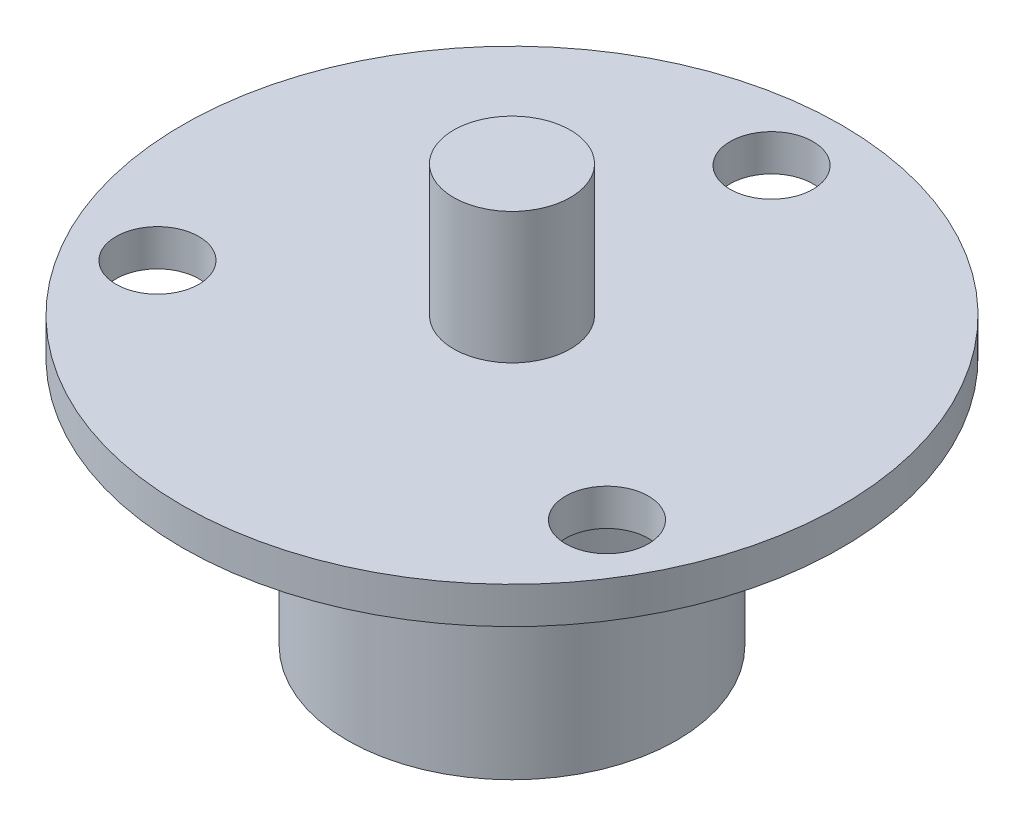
from build123d import *

# Parameters (mm, degrees)
SKETCH1_R           = 10.9601
BOSS_EXTRUDE1_DEPTH = 16.5862
SKETCH2_R           = 21.9329
SKETCH2_R_2         = 2.7559
BOSS_EXTRUDE2_DEPTH = 2.4384
SKETCH3_R           = 3.8862
BOSS_EXTRUDE3_DEPTH = 8.73125


with BuildPart() as part:
    # Sketch1 → Boss-Extrude1 (new body)
    with BuildSketch(Plane(origin=(0, 0, 0), x_dir=(1, 0, 0), z_dir=(0, 1, 0))):
        with Locations(Location((0, 0, 0), (0, 0, 270))):
            Circle(SKETCH1_R)
    extrude(amount=BOSS_EXTRUDE1_DEPTH)

    # Sketch2 → Boss-Extrude2 (add)
    with BuildSketch(Plane(origin=(0, 16.5862, 0), x_dir=(1, 0, 0), z_dir=(0, 1, 0))):
        with Locations(Location((0, 0, 0), (0, 0, 270))):
            Circle(SKETCH2_R)
        with Locations(Location((0, 17.272, 0), (0, 0, 270))):
            Circle(SKETCH2_R_2, mode=Mode.SUBTRACT)
        with Locations(Location((14.957990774, -8.636, 0), (0, 0, 270))):
            Circle(SKETCH2_R_2, mode=Mode.SUBTRACT)
        with Locations(Location((-14.957990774, -8.636, 0), (0, 0, 270))):
            Circle(SKETCH2_R_2, mode=Mode.SUBTRACT)
    extrude(amount=BOSS_EXTRUDE2_DEPTH)

    # Sketch3 → Boss-Extrude3 (add)
    with BuildSketch(Plane(origin=(0, 19.0246, 0), x_dir=(1, 0, 0), z_dir=(0, 1, 0))):
        with Locations(Location((0, 0, 0), (0, 0, 270))):
            Circle(SKETCH3_R)
    extrude(amount=BOSS_EXTRUDE3_DEPTH)


solid = part.part
